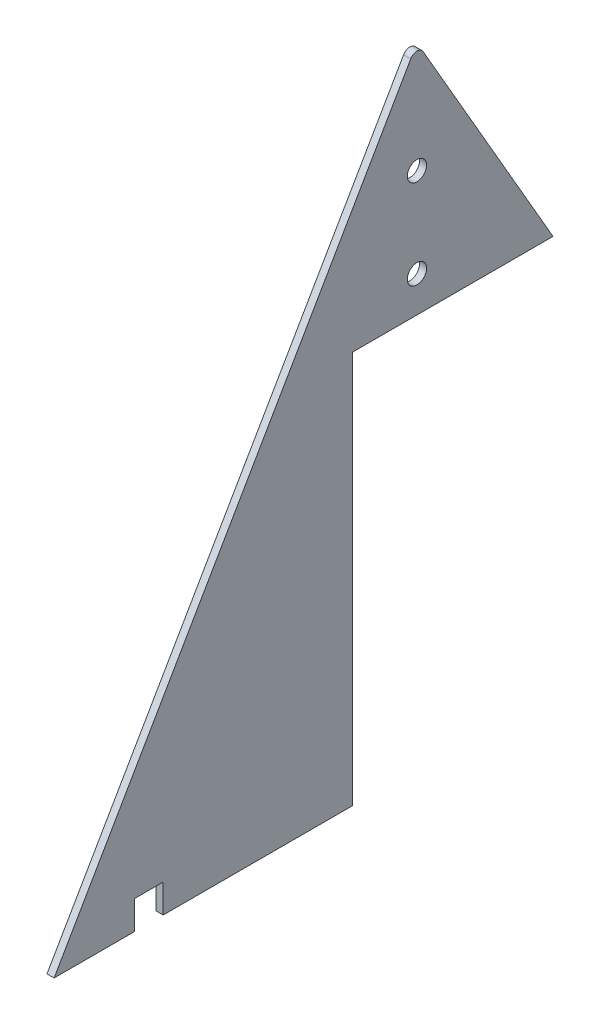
ISO-10303-21;
HEADER;
FILE_DESCRIPTION(('STEP AP214'),'2;1');
FILE_NAME('part.step','',(''),(''),'','','');
FILE_SCHEMA(('AUTOMOTIVE_DESIGN { 1 0 10303 214 1 1 1 1 }'));
ENDSEC;
DATA;
#1=APPLICATION_CONTEXT('core data for automotive mechanical design processes');
#2=APPLICATION_PROTOCOL_DEFINITION('international standard','automotive_design',2000,#1);
#3=PRODUCT_CONTEXT('',#1,'mechanical');
#4=PRODUCT('Part','Part','',(#3));
#5=PRODUCT_RELATED_PRODUCT_CATEGORY('part','',(#4));
#6=PRODUCT_DEFINITION_FORMATION('','',#4);
#7=PRODUCT_DEFINITION_CONTEXT('part definition',#1,'design');
#8=PRODUCT_DEFINITION('design','',#6,#7);
#9=PRODUCT_DEFINITION_SHAPE('','',#8);
#10=(LENGTH_UNIT() NAMED_UNIT(*) SI_UNIT(.MILLI.,.METRE.));
#11=(NAMED_UNIT(*) PLANE_ANGLE_UNIT() SI_UNIT($,.RADIAN.));
#12=(NAMED_UNIT(*) SI_UNIT($,.STERADIAN.) SOLID_ANGLE_UNIT());
#13=UNCERTAINTY_MEASURE_WITH_UNIT(LENGTH_MEASURE(1.E-05),#10,'distance_accuracy_value','');
#14=(GEOMETRIC_REPRESENTATION_CONTEXT(3) GLOBAL_UNCERTAINTY_ASSIGNED_CONTEXT((#13)) GLOBAL_UNIT_ASSIGNED_CONTEXT((#10,
#11,#12)) REPRESENTATION_CONTEXT('',''));
#15=CARTESIAN_POINT('',(0.,0.,0.));
#16=DIRECTION('',(0.,0.,1.));
#17=DIRECTION('',(1.,0.,0.));
#18=AXIS2_PLACEMENT_3D('',#15,#16,#17);
#19=CARTESIAN_POINT('',(2.,0.,0.));
#20=DIRECTION('',(0.,1.,0.));
#21=DIRECTION('',(0.,0.,1.));
#22=AXIS2_PLACEMENT_3D('',#19,#20,#21);
#23=PLANE('',#22);
#24=DIRECTION('',(0.,0.,-1.));
#25=VECTOR('',#24,1.);
#26=CARTESIAN_POINT('',(2.,0.,101.613647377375));
#27=LINE('',#26,#25);
#28=CARTESIAN_POINT('',(2.,0.,71.0734488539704));
#29=VERTEX_POINT('',#28);
#30=CARTESIAN_POINT('',(2.,0.,18.));
#31=VERTEX_POINT('',#30);
#32=EDGE_CURVE('E179',#29,#31,#27,.T.);
#33=ORIENTED_EDGE('',*,*,#32,.F.);
#34=DIRECTION('',(-1.,0.,0.));
#35=VECTOR('',#34,1.);
#36=CARTESIAN_POINT('',(13.3137084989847,0.,71.0734488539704));
#37=LINE('',#36,#35);
#38=CARTESIAN_POINT('',(0.,0.,71.0734488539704));
#39=VERTEX_POINT('',#38);
#40=EDGE_CURVE('E116',#29,#39,#37,.T.);
#41=ORIENTED_EDGE('',*,*,#40,.T.);
#42=DIRECTION('',(0.,0.,-1.));
#43=VECTOR('',#42,1.);
#44=CARTESIAN_POINT('',(0.,0.,0.));
#45=LINE('',#44,#43);
#46=CARTESIAN_POINT('',(0.,0.,18.));
#47=VERTEX_POINT('',#46);
#48=EDGE_CURVE('E172',#39,#47,#45,.T.);
#49=ORIENTED_EDGE('',*,*,#48,.T.);
#50=DIRECTION('',(1.,0.,0.));
#51=VECTOR('',#50,1.);
#52=CARTESIAN_POINT('',(0.,0.,18.));
#53=LINE('',#52,#51);
#54=EDGE_CURVE('E169',#47,#31,#53,.T.);
#55=ORIENTED_EDGE('',*,*,#54,.T.);
#56=EDGE_LOOP('',(#33,#41,#49,#55));
#57=FACE_BOUND('',#56,.T.);
#58=ADVANCED_FACE('F32',(#57),#23,.F.);
#59=CARTESIAN_POINT('',(0.,0.,101.613647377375));
#60=VERTEX_POINT('',#59);
#61=CARTESIAN_POINT('',(0.,0.,79.0734488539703));
#62=VERTEX_POINT('',#61);
#63=EDGE_CURVE('E186',#60,#62,#45,.T.);
#64=ORIENTED_EDGE('',*,*,#63,.T.);
#65=DIRECTION('',(-1.,0.,0.));
#66=VECTOR('',#65,1.);
#67=CARTESIAN_POINT('',(13.3137084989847,0.,79.0734488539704));
#68=LINE('',#67,#66);
#69=CARTESIAN_POINT('',(2.,0.,79.0734488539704));
#70=VERTEX_POINT('',#69);
#71=EDGE_CURVE('E47',#70,#62,#68,.T.);
#72=ORIENTED_EDGE('',*,*,#71,.F.);
#73=CARTESIAN_POINT('',(2.,0.,101.613647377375));
#74=VERTEX_POINT('',#73);
#75=EDGE_CURVE('E176',#74,#70,#27,.T.);
#76=ORIENTED_EDGE('',*,*,#75,.F.);
#77=DIRECTION('',(-1.,0.,0.));
#78=VECTOR('',#77,1.);
#79=CARTESIAN_POINT('',(2.,0.,101.613647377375));
#80=LINE('',#79,#78);
#81=EDGE_CURVE('E185',#74,#60,#80,.T.);
#82=ORIENTED_EDGE('',*,*,#81,.T.);
#83=EDGE_LOOP('',(#64,#72,#76,#82));
#84=FACE_BOUND('',#83,.T.);
#85=ADVANCED_FACE('F34',(#84),#23,.F.);
#86=CARTESIAN_POINT('',(2.,0.,-101.613647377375));
#87=DIRECTION('',(0.,-0.500000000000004,0.866025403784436));
#88=DIRECTION('',(0.,-0.866025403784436,-0.500000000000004));
#89=AXIS2_PLACEMENT_3D('',#86,#87,#88);
#90=PLANE('',#89);
#91=DIRECTION('',(0.,0.866025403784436,0.500000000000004));
#92=VECTOR('',#91,1.);
#93=CARTESIAN_POINT('',(2.,0.,-101.613647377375));
#94=LINE('',#93,#92);
#95=CARTESIAN_POINT('',(2.,110.,-38.1051177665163));
#96=VERTEX_POINT('',#95);
#97=CARTESIAN_POINT('',(2.,173.,-1.73205080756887));
#98=VERTEX_POINT('',#97);
#99=EDGE_CURVE('E178',#96,#98,#94,.T.);
#100=ORIENTED_EDGE('',*,*,#99,.F.);
#101=DIRECTION('',(1.,0.,0.));
#102=VECTOR('',#101,1.);
#103=CARTESIAN_POINT('',(0.,110.,-38.1051177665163));
#104=LINE('',#103,#102);
#105=CARTESIAN_POINT('',(0.,110.,-38.1051177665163));
#106=VERTEX_POINT('',#105);
#107=EDGE_CURVE('E164',#106,#96,#104,.T.);
#108=ORIENTED_EDGE('',*,*,#107,.F.);
#109=DIRECTION('',(0.,0.866025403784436,0.500000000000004));
#110=VECTOR('',#109,1.);
#111=CARTESIAN_POINT('',(0.,0.,-101.613647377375));
#112=LINE('',#111,#110);
#113=CARTESIAN_POINT('',(0.,173.,-1.73205080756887));
#114=VERTEX_POINT('',#113);
#115=EDGE_CURVE('E189',#106,#114,#112,.T.);
#116=ORIENTED_EDGE('',*,*,#115,.T.);
#117=DIRECTION('',(-1.,0.,0.));
#118=VECTOR('',#117,1.);
#119=CARTESIAN_POINT('',(2.,173.,-1.73205080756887));
#120=LINE('',#119,#118);
#121=EDGE_CURVE('E11',#98,#114,#120,.T.);
#122=ORIENTED_EDGE('',*,*,#121,.F.);
#123=EDGE_LOOP('',(#100,#108,#116,#122));
#124=FACE_BOUND('',#123,.T.);
#125=ADVANCED_FACE('F218',(#124),#90,.F.);
#126=CARTESIAN_POINT('',(2.,172.,0.));
#127=DIRECTION('',(-1.,0.,0.));
#128=DIRECTION('',(0.,0.,1.));
#129=AXIS2_PLACEMENT_3D('',#126,#127,#128);
#130=CYLINDRICAL_SURFACE('',#129,2.);
#131=CARTESIAN_POINT('',(0.,172.,0.));
#132=DIRECTION('',(1.,0.,0.));
#133=DIRECTION('',(0.,0.,-1.));
#134=AXIS2_PLACEMENT_3D('',#131,#132,#133);
#135=CIRCLE('',#134,2.);
#136=CARTESIAN_POINT('',(0.,173.,1.73205080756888));
#137=VERTEX_POINT('',#136);
#138=EDGE_CURVE('E191',#114,#137,#135,.T.);
#139=ORIENTED_EDGE('',*,*,#138,.T.);
#140=DIRECTION('',(-1.,0.,0.));
#141=VECTOR('',#140,1.);
#142=CARTESIAN_POINT('',(2.,173.,1.73205080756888));
#143=LINE('',#142,#141);
#144=CARTESIAN_POINT('',(2.,173.,1.73205080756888));
#145=VERTEX_POINT('',#144);
#146=EDGE_CURVE('E40',#145,#137,#143,.T.);
#147=ORIENTED_EDGE('',*,*,#146,.F.);
#148=CARTESIAN_POINT('',(2.,172.,0.));
#149=DIRECTION('',(1.,0.,0.));
#150=DIRECTION('',(0.,0.,-1.));
#151=AXIS2_PLACEMENT_3D('',#148,#149,#150);
#152=CIRCLE('',#151,2.);
#153=EDGE_CURVE('E181',#98,#145,#152,.T.);
#154=ORIENTED_EDGE('',*,*,#153,.F.);
#155=ORIENTED_EDGE('',*,*,#121,.T.);
#156=EDGE_LOOP('',(#139,#147,#154,#155));
#157=FACE_BOUND('',#156,.T.);
#158=ADVANCED_FACE('F216',(#157),#130,.T.);
#159=CARTESIAN_POINT('',(2.,173.,1.73205080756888));
#160=DIRECTION('',(0.,-0.500000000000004,-0.866025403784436));
#161=DIRECTION('',(0.,0.866025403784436,-0.500000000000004));
#162=AXIS2_PLACEMENT_3D('',#159,#160,#161);
#163=PLANE('',#162);
#164=DIRECTION('',(0.,-0.866025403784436,0.500000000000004));
#165=VECTOR('',#164,1.);
#166=CARTESIAN_POINT('',(0.,173.,1.73205080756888));
#167=LINE('',#166,#165);
#168=EDGE_CURVE('E193',#137,#60,#167,.T.);
#169=ORIENTED_EDGE('',*,*,#168,.T.);
#170=ORIENTED_EDGE('',*,*,#81,.F.);
#171=DIRECTION('',(0.,-0.866025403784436,0.500000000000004));
#172=VECTOR('',#171,1.);
#173=CARTESIAN_POINT('',(2.,173.,1.73205080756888));
#174=LINE('',#173,#172);
#175=EDGE_CURVE('E183',#145,#74,#174,.T.);
#176=ORIENTED_EDGE('',*,*,#175,.F.);
#177=ORIENTED_EDGE('',*,*,#146,.T.);
#178=EDGE_LOOP('',(#169,#170,#176,#177));
#179=FACE_BOUND('',#178,.T.);
#180=ADVANCED_FACE('F202',(#179),#163,.F.);
#181=CARTESIAN_POINT('',(2.,172.,0.));
#182=DIRECTION('',(1.,0.,0.));
#183=DIRECTION('',(0.,0.,-1.));
#184=AXIS2_PLACEMENT_3D('',#181,#182,#183);
#185=PLANE('',#184);
#186=DIRECTION('',(0.,-1.,0.));
#187=VECTOR('',#186,1.);
#188=CARTESIAN_POINT('',(2.,7.99999999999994,71.0734488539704));
#189=LINE('',#188,#187);
#190=CARTESIAN_POINT('',(2.,7.99999999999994,71.0734488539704));
#191=VERTEX_POINT('',#190);
#192=EDGE_CURVE('E110',#191,#29,#189,.T.);
#193=ORIENTED_EDGE('',*,*,#192,.T.);
#194=ORIENTED_EDGE('',*,*,#32,.T.);
#195=DIRECTION('',(0.,-1.,0.));
#196=VECTOR('',#195,1.);
#197=CARTESIAN_POINT('',(2.,110.,18.));
#198=LINE('',#197,#196);
#199=CARTESIAN_POINT('',(2.,110.,18.));
#200=VERTEX_POINT('',#199);
#201=EDGE_CURVE('E162',#200,#31,#198,.T.);
#202=ORIENTED_EDGE('',*,*,#201,.F.);
#203=DIRECTION('',(0.,0.,1.));
#204=VECTOR('',#203,1.);
#205=CARTESIAN_POINT('',(2.,110.,-38.1051177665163));
#206=LINE('',#205,#204);
#207=EDGE_CURVE('E158',#96,#200,#206,.T.);
#208=ORIENTED_EDGE('',*,*,#207,.F.);
#209=ORIENTED_EDGE('',*,*,#99,.T.);
#210=ORIENTED_EDGE('',*,*,#153,.T.);
#211=ORIENTED_EDGE('',*,*,#175,.T.);
#212=ORIENTED_EDGE('',*,*,#75,.T.);
#213=DIRECTION('',(0.,1.,0.));
#214=VECTOR('',#213,1.);
#215=CARTESIAN_POINT('',(2.,7.99999999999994,79.0734488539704));
#216=LINE('',#215,#214);
#217=CARTESIAN_POINT('',(2.,7.99999999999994,79.0734488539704));
#218=VERTEX_POINT('',#217);
#219=EDGE_CURVE('E133',#70,#218,#216,.T.);
#220=ORIENTED_EDGE('',*,*,#219,.T.);
#221=DIRECTION('',(0.,0.,-1.));
#222=VECTOR('',#221,1.);
#223=CARTESIAN_POINT('',(2.,7.99999999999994,79.0734488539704));
#224=LINE('',#223,#222);
#225=EDGE_CURVE('E123',#218,#191,#224,.T.);
#226=ORIENTED_EDGE('',*,*,#225,.T.);
#227=EDGE_LOOP('',(#193,#194,#202,#208,#209,#210,#211,#212,#220,#226));
#228=FACE_BOUND('',#227,.T.);
#229=CARTESIAN_POINT('',(2.,145.,0.));
#230=DIRECTION('',(1.,0.,0.));
#231=DIRECTION('',(0.,0.,-1.));
#232=AXIS2_PLACEMENT_3D('',#229,#230,#231);
#233=CIRCLE('',#232,2.70000000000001);
#234=CARTESIAN_POINT('',(2.,145.,-2.70000000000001));
#235=VERTEX_POINT('',#234);
#236=EDGE_CURVE('E146',#235,#235,#233,.T.);
#237=ORIENTED_EDGE('',*,*,#236,.F.);
#238=EDGE_LOOP('',(#237));
#239=FACE_BOUND('',#238,.T.);
#240=CARTESIAN_POINT('',(2.,120.,0.));
#241=DIRECTION('',(1.,0.,0.));
#242=DIRECTION('',(0.,0.,-1.));
#243=AXIS2_PLACEMENT_3D('',#240,#241,#242);
#244=CIRCLE('',#243,2.69999999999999);
#245=CARTESIAN_POINT('',(2.,120.,-2.69999999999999));
#246=VERTEX_POINT('',#245);
#247=EDGE_CURVE('E152',#246,#246,#244,.T.);
#248=ORIENTED_EDGE('',*,*,#247,.F.);
#249=EDGE_LOOP('',(#248));
#250=FACE_BOUND('',#249,.T.);
#251=ADVANCED_FACE('F130',(#228,#239,#250),#185,.T.);
#252=CARTESIAN_POINT('',(0.,172.,0.));
#253=DIRECTION('',(1.,0.,0.));
#254=DIRECTION('',(0.,0.,-1.));
#255=AXIS2_PLACEMENT_3D('',#252,#253,#254);
#256=PLANE('',#255);
#257=CARTESIAN_POINT('',(0.,145.,0.));
#258=DIRECTION('',(1.,0.,0.));
#259=DIRECTION('',(0.,0.,-1.));
#260=AXIS2_PLACEMENT_3D('',#257,#258,#259);
#261=CIRCLE('',#260,2.70000000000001);
#262=CARTESIAN_POINT('',(0.,145.,-2.70000000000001));
#263=VERTEX_POINT('',#262);
#264=EDGE_CURVE('E149',#263,#263,#261,.T.);
#265=ORIENTED_EDGE('',*,*,#264,.T.);
#266=EDGE_LOOP('',(#265));
#267=FACE_BOUND('',#266,.T.);
#268=CARTESIAN_POINT('',(0.,120.,0.));
#269=DIRECTION('',(1.,0.,0.));
#270=DIRECTION('',(0.,0.,-1.));
#271=AXIS2_PLACEMENT_3D('',#268,#269,#270);
#272=CIRCLE('',#271,2.69999999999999);
#273=CARTESIAN_POINT('',(0.,120.,-2.69999999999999));
#274=VERTEX_POINT('',#273);
#275=EDGE_CURVE('E155',#274,#274,#272,.T.);
#276=ORIENTED_EDGE('',*,*,#275,.T.);
#277=EDGE_LOOP('',(#276));
#278=FACE_BOUND('',#277,.T.);
#279=ORIENTED_EDGE('',*,*,#48,.F.);
#280=DIRECTION('',(0.,-1.,0.));
#281=VECTOR('',#280,1.);
#282=CARTESIAN_POINT('',(0.,7.99999999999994,71.0734488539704));
#283=LINE('',#282,#281);
#284=CARTESIAN_POINT('',(0.,7.99999999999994,71.0734488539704));
#285=VERTEX_POINT('',#284);
#286=EDGE_CURVE('E134',#285,#39,#283,.T.);
#287=ORIENTED_EDGE('',*,*,#286,.F.);
#288=DIRECTION('',(0.,0.,-1.));
#289=VECTOR('',#288,1.);
#290=CARTESIAN_POINT('',(0.,7.99999999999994,79.0734488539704));
#291=LINE('',#290,#289);
#292=CARTESIAN_POINT('',(0.,7.99999999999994,79.0734488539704));
#293=VERTEX_POINT('',#292);
#294=EDGE_CURVE('E126',#293,#285,#291,.T.);
#295=ORIENTED_EDGE('',*,*,#294,.F.);
#296=DIRECTION('',(0.,1.,0.));
#297=VECTOR('',#296,1.);
#298=CARTESIAN_POINT('',(0.,7.99999999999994,79.0734488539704));
#299=LINE('',#298,#297);
#300=EDGE_CURVE('E139',#62,#293,#299,.T.);
#301=ORIENTED_EDGE('',*,*,#300,.F.);
#302=ORIENTED_EDGE('',*,*,#63,.F.);
#303=ORIENTED_EDGE('',*,*,#168,.F.);
#304=ORIENTED_EDGE('',*,*,#138,.F.);
#305=ORIENTED_EDGE('',*,*,#115,.F.);
#306=DIRECTION('',(0.,0.,1.));
#307=VECTOR('',#306,1.);
#308=CARTESIAN_POINT('',(0.,110.,-38.1051177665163));
#309=LINE('',#308,#307);
#310=CARTESIAN_POINT('',(0.,110.,18.));
#311=VERTEX_POINT('',#310);
#312=EDGE_CURVE('E159',#106,#311,#309,.T.);
#313=ORIENTED_EDGE('',*,*,#312,.T.);
#314=DIRECTION('',(0.,-1.,0.));
#315=VECTOR('',#314,1.);
#316=CARTESIAN_POINT('',(0.,110.,18.));
#317=LINE('',#316,#315);
#318=EDGE_CURVE('E55',#311,#47,#317,.T.);
#319=ORIENTED_EDGE('',*,*,#318,.T.);
#320=EDGE_LOOP('',(#279,#287,#295,#301,#302,#303,#304,#305,#313,#319));
#321=FACE_BOUND('',#320,.T.);
#322=ADVANCED_FACE('F209',(#267,#278,#321),#256,.F.);
#323=CARTESIAN_POINT('',(0.,110.,18.));
#324=DIRECTION('',(0.,0.,1.));
#325=DIRECTION('',(0.,-1.,0.));
#326=AXIS2_PLACEMENT_3D('',#323,#324,#325);
#327=PLANE('',#326);
#328=ORIENTED_EDGE('',*,*,#201,.T.);
#329=ORIENTED_EDGE('',*,*,#54,.F.);
#330=ORIENTED_EDGE('',*,*,#318,.F.);
#331=DIRECTION('',(1.,0.,0.));
#332=VECTOR('',#331,1.);
#333=CARTESIAN_POINT('',(0.,110.,18.));
#334=LINE('',#333,#332);
#335=EDGE_CURVE('E173',#311,#200,#334,.T.);
#336=ORIENTED_EDGE('',*,*,#335,.T.);
#337=EDGE_LOOP('',(#328,#329,#330,#336));
#338=FACE_BOUND('',#337,.T.);
#339=ADVANCED_FACE('F223',(#338),#327,.F.);
#340=CARTESIAN_POINT('',(0.,110.,-38.1051177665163));
#341=DIRECTION('',(0.,1.,0.));
#342=DIRECTION('',(0.,0.,1.));
#343=AXIS2_PLACEMENT_3D('',#340,#341,#342);
#344=PLANE('',#343);
#345=ORIENTED_EDGE('',*,*,#207,.T.);
#346=ORIENTED_EDGE('',*,*,#335,.F.);
#347=ORIENTED_EDGE('',*,*,#312,.F.);
#348=ORIENTED_EDGE('',*,*,#107,.T.);
#349=EDGE_LOOP('',(#345,#346,#347,#348));
#350=FACE_BOUND('',#349,.T.);
#351=ADVANCED_FACE('F221',(#350),#344,.F.);
#352=CARTESIAN_POINT('',(2.,120.,0.));
#353=DIRECTION('',(1.,0.,0.));
#354=DIRECTION('',(0.,0.,-1.));
#355=AXIS2_PLACEMENT_3D('',#352,#353,#354);
#356=CYLINDRICAL_SURFACE('',#355,2.69999999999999);
#357=ORIENTED_EDGE('',*,*,#275,.F.);
#358=EDGE_LOOP('',(#357));
#359=FACE_BOUND('',#358,.T.);
#360=ORIENTED_EDGE('',*,*,#247,.T.);
#361=EDGE_LOOP('',(#360));
#362=FACE_BOUND('',#361,.T.);
#363=ADVANCED_FACE('F253',(#359,#362),#356,.F.);
#364=CARTESIAN_POINT('',(2.,145.,0.));
#365=DIRECTION('',(1.,0.,0.));
#366=DIRECTION('',(0.,0.,-1.));
#367=AXIS2_PLACEMENT_3D('',#364,#365,#366);
#368=CYLINDRICAL_SURFACE('',#367,2.70000000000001);
#369=ORIENTED_EDGE('',*,*,#264,.F.);
#370=EDGE_LOOP('',(#369));
#371=FACE_BOUND('',#370,.T.);
#372=ORIENTED_EDGE('',*,*,#236,.T.);
#373=EDGE_LOOP('',(#372));
#374=FACE_BOUND('',#373,.T.);
#375=ADVANCED_FACE('F258',(#371,#374),#368,.F.);
#376=CARTESIAN_POINT('',(13.3137084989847,7.99999999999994,79.0734488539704));
#377=DIRECTION('',(0.,1.,0.));
#378=DIRECTION('',(0.,0.,1.));
#379=AXIS2_PLACEMENT_3D('',#376,#377,#378);
#380=PLANE('',#379);
#381=DIRECTION('',(-1.,0.,0.));
#382=VECTOR('',#381,1.);
#383=CARTESIAN_POINT('',(13.3137084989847,7.99999999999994,79.0734488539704));
#384=LINE('',#383,#382);
#385=EDGE_CURVE('E141',#218,#293,#384,.T.);
#386=ORIENTED_EDGE('',*,*,#385,.T.);
#387=ORIENTED_EDGE('',*,*,#294,.T.);
#388=DIRECTION('',(-1.,0.,0.));
#389=VECTOR('',#388,1.);
#390=CARTESIAN_POINT('',(13.3137084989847,7.99999999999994,71.0734488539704));
#391=LINE('',#390,#389);
#392=EDGE_CURVE('E113',#191,#285,#391,.T.);
#393=ORIENTED_EDGE('',*,*,#392,.F.);
#394=ORIENTED_EDGE('',*,*,#225,.F.);
#395=EDGE_LOOP('',(#386,#387,#393,#394));
#396=FACE_BOUND('',#395,.T.);
#397=ADVANCED_FACE('F122',(#396),#380,.F.);
#398=CARTESIAN_POINT('',(13.3137084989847,7.99999999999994,71.0734488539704));
#399=DIRECTION('',(0.,0.,-1.));
#400=DIRECTION('',(-1.,0.,0.));
#401=AXIS2_PLACEMENT_3D('',#398,#399,#400);
#402=PLANE('',#401);
#403=ORIENTED_EDGE('',*,*,#392,.T.);
#404=ORIENTED_EDGE('',*,*,#286,.T.);
#405=ORIENTED_EDGE('',*,*,#40,.F.);
#406=ORIENTED_EDGE('',*,*,#192,.F.);
#407=EDGE_LOOP('',(#403,#404,#405,#406));
#408=FACE_BOUND('',#407,.T.);
#409=ADVANCED_FACE('F112',(#408),#402,.F.);
#410=CARTESIAN_POINT('',(13.3137084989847,7.99999999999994,79.0734488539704));
#411=DIRECTION('',(0.,0.,1.));
#412=DIRECTION('',(1.,0.,0.));
#413=AXIS2_PLACEMENT_3D('',#410,#411,#412);
#414=PLANE('',#413);
#415=ORIENTED_EDGE('',*,*,#71,.T.);
#416=ORIENTED_EDGE('',*,*,#300,.T.);
#417=ORIENTED_EDGE('',*,*,#385,.F.);
#418=ORIENTED_EDGE('',*,*,#219,.F.);
#419=EDGE_LOOP('',(#415,#416,#417,#418));
#420=FACE_BOUND('',#419,.T.);
#421=ADVANCED_FACE('F225',(#420),#414,.F.);
#422=CLOSED_SHELL('',(#58,#85,#125,#158,#180,#251,#322,#339,#351,#363,#375,#397,#409,#421));
#423=MANIFOLD_SOLID_BREP('B2',#422);
#424=ADVANCED_BREP_SHAPE_REPRESENTATION('',(#18,#423),#14);
#425=SHAPE_DEFINITION_REPRESENTATION(#9,#424);
ENDSEC;
END-ISO-10303-21;
